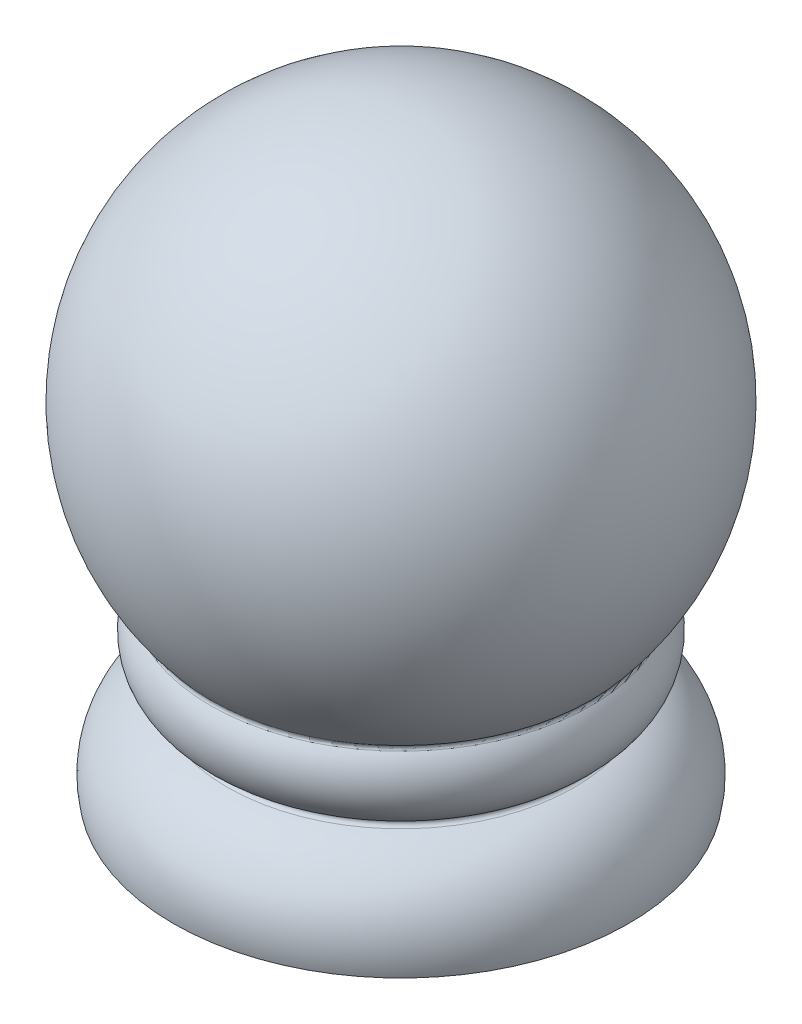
from build123d import *

# Parameters (mm, degrees)
SKETCH5_R           = 4.5
BOSS_EXTRUDE1_DEPTH = 6
BOSS_EXTRUDE1_TAPER = 1
SKETCH6_R           = 3.25
CUT_EXTRUDE2_DEPTH  = 10
FILLET1_R           = 0.25
FILLET2_R           = 2


with BuildPart() as part:
    # Sketch1 → Base-Revolve (revolve)
    with BuildSketch(Plane.XY, mode=Mode.PRIVATE) as base_revolve_sk:
        with BuildLine():
            Line((0, 0), (14.5, 0))
            ThreePointArc((14.5, 0), (13.903972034, 3.56762287), (11.057781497, 5.799747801))
            ThreePointArc((11.057781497, 5.799747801), (10.8810389, 6.021920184), (11.025941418, 6.266054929))
            ThreePointArc((11.025941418, 6.266054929), (12.687766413, 8.286467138), (12.132204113, 10.842847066))
            ThreePointArc((12.132204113, 10.842847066), (12.078970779, 11.002682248), (12.139233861, 11.160001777))
            ThreePointArc((12.139233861, 11.160001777), (14.539051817, 28.262524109), (0, 37.583005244))
            Line((0, 37.583005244), (0, 0))
        make_face()
    revolve(base_revolve_sk.sketch.rotate(Axis((0, 77.244222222, 0), (0, -1, 0)), 90), axis=Axis((0, 77.244222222, 0), (0, -1, 0)))

    # Sketch4 → Cut-Revolve1 (revolve, cut)
    with BuildSketch(Plane.XY, mode=Mode.PRIVATE) as cut_revolve1_sk:
        Polygon((13.5, -1.86135809), (13.5, 2), (12.5, 2), (10, 6), (10, 30), (0, 30), (0, -1.86135809), align=None)
    revolve(cut_revolve1_sk.sketch.rotate(Axis((0, 39.34181807, 0), (0, -1, 0)), 90), axis=Axis((0, 39.34181807, 0), (0, -1, 0)), mode=Mode.SUBTRACT)

    # Sketch5 → Boss-Extrude1 (add)
    with BuildSketch(Plane.XZ.offset(-30)):
        Circle(SKETCH5_R)
    extrude(amount=BOSS_EXTRUDE1_DEPTH, taper=BOSS_EXTRUDE1_TAPER)

    # Sketch6 → Cut-Extrude2 (cut)
    with BuildSketch(Plane.XZ.offset(-24)):
        with Locations(Location((0, 0, 0), (0, 0, 270))):
            Circle(SKETCH6_R)
    extrude(amount=-CUT_EXTRUDE2_DEPTH, mode=Mode.SUBTRACT)

    # Fillet1
    fillet1_edges = [part.edges().sort_by_distance(p)[0] for p in [
        (0, 2, -12.5),
        (-4.39526961, 24, 0),
    ]]
    fillet(fillet1_edges, radius=FILLET1_R)

    # Fillet2
    fillet2_edges = [part.edges().sort_by_distance(p)[0] for p in [
        (0, 30, -10),
    ]]
    fillet(fillet2_edges, radius=FILLET2_R)


solid = part.part
